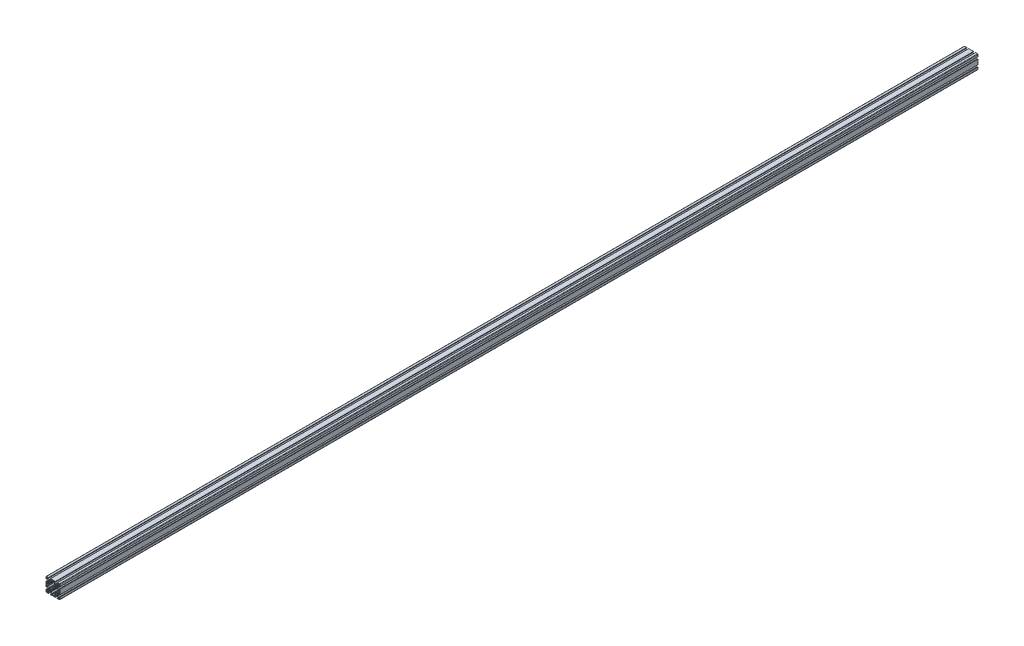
from build123d import *

# Parameters (mm, degrees)
EXTRUDE1_DEPTH = 4000


with BuildPart() as part:
    # Sketch1 → Extrude1 (new body)
    with BuildSketch(Plane.XY):
        with BuildLine():
            Line((-14.49997, -25.99994), (-13.242500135, -25.99994))
            ThreePointArc((-13.242500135, -25.99994), (-12.888946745, -25.853493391), (-12.742500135, -25.49994))
            Line((-12.742500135, -25.49994), (-12.742500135, -22.267405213))
            ThreePointArc((-12.742500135, -22.267405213), (-12.602474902, -21.902627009), (-12.242805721, -21.7499565))
            Line((-12.242805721, -21.7499565), (-10.260208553, -21.7499565))
            ThreePointArc((-10.260208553, -21.7499565), (-10.068867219, -21.788016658), (-9.906655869, -21.896402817))
            Line((-9.906655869, -21.896402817), (-5.981129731, -25.821928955))
            ThreePointArc((-5.981129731, -25.821928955), (-5.872743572, -25.984140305), (-5.834683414, -26.175481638))
            Line((-5.834683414, -26.175481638), (-5.834683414, -29.112441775))
            Line((-5.834683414, -29.112441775), (-5.324684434, -30.062439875))
            Line((-5.324684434, -30.062439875), (-5.834683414, -31.012437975))
            Line((-5.834683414, -31.012437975), (-5.834683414, -33.824398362))
            ThreePointArc((-5.834683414, -33.824398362), (-5.872743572, -34.015739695), (-5.981129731, -34.177951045))
            Line((-5.981129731, -34.177951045), (-9.906655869, -38.103477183))
            ThreePointArc((-9.906655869, -38.103477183), (-10.068867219, -38.211863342), (-10.260208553, -38.2499235))
            Line((-10.260208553, -38.2499235), (-12.242805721, -38.2499235))
            ThreePointArc((-12.242805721, -38.2499235), (-12.602474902, -38.097252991), (-12.742500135, -37.732474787))
            Line((-12.742500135, -37.732474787), (-12.742500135, -34.49994))
            ThreePointArc((-12.742500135, -34.49994), (-12.888946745, -34.146386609), (-13.242500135, -33.99994))
            Line((-13.242500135, -33.99994), (-14.49997, -33.99994))
            ThreePointArc((-14.49997, -33.99994), (-14.853523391, -34.146386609), (-14.99997, -34.49994))
            Line((-14.99997, -34.49994), (-14.99997, -42.999914))
            ThreePointArc((-14.99997, -42.999914), (-14.414184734, -44.414124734), (-12.999974, -44.99991))
            Line((-12.999974, -44.99991), (-4.5, -44.99991))
            ThreePointArc((-4.5, -44.99991), (-4.146446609, -44.853463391), (-4, -44.49991))
            Line((-4, -44.49991), (-4, -43.242440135))
            ThreePointArc((-4, -43.242440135), (-4.146446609, -42.888886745), (-4.5, -42.742440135))
            Line((-4.5, -42.742440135), (-7.732534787, -42.742440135))
            ThreePointArc((-7.732534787, -42.742440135), (-8.097312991, -42.602414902), (-8.2499835, -42.242745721))
            Line((-8.2499835, -42.242745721), (-8.2499835, -40.260148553))
            ThreePointArc((-8.2499835, -40.260148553), (-8.211923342, -40.068807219), (-8.103537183, -39.906595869))
            Line((-8.103537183, -39.906595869), (-4.178011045, -35.981069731))
            ThreePointArc((-4.178011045, -35.981069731), (-4.015799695, -35.872683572), (-3.824458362, -35.834623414))
            Line((-3.824458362, -35.834623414), (-0.9499981, -35.834623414))
            Line((-0.9499981, -35.834623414), (0, -35.324624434))
            Line((0, -35.324624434), (0.9499981, -35.834623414))
            Line((0.9499981, -35.834623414), (3.824458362, -35.834623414))
            ThreePointArc((3.824458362, -35.834623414), (4.015799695, -35.872683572), (4.178011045, -35.981069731))
            Line((4.178011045, -35.981069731), (8.103537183, -39.906595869))
            ThreePointArc((8.103537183, -39.906595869), (8.211923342, -40.068807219), (8.2499835, -40.260148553))
            Line((8.2499835, -40.260148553), (8.2499835, -42.242745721))
            ThreePointArc((8.2499835, -42.242745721), (8.097312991, -42.602414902), (7.732534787, -42.742440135))
            Line((7.732534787, -42.742440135), (4.5, -42.742440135))
            ThreePointArc((4.5, -42.742440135), (4.146446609, -42.888886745), (4, -43.242440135))
            Line((4, -43.242440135), (4, -44.49991))
            ThreePointArc((4, -44.49991), (4.146446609, -44.853463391), (4.5, -44.99991))
            Line((4.5, -44.99991), (25.49994, -44.99991))
            ThreePointArc((25.49994, -44.99991), (25.853493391, -44.853463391), (25.99994, -44.49991))
            Line((25.99994, -44.49991), (25.99994, -43.242440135))
            ThreePointArc((25.99994, -43.242440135), (25.853493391, -42.888886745), (25.49994, -42.742440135))
            Line((25.49994, -42.742440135), (22.267405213, -42.742440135))
            ThreePointArc((22.267405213, -42.742440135), (21.902627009, -42.602414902), (21.7499565, -42.242745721))
            Line((21.7499565, -42.242745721), (21.7499565, -40.260148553))
            ThreePointArc((21.7499565, -40.260148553), (21.788016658, -40.068807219), (21.896402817, -39.906595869))
            Line((21.896402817, -39.906595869), (25.821928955, -35.981069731))
            ThreePointArc((25.821928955, -35.981069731), (25.984140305, -35.872683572), (26.175481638, -35.834623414))
            Line((26.175481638, -35.834623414), (29.0499419, -35.834623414))
            Line((29.0499419, -35.834623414), (29.99994, -35.324624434))
            Line((29.99994, -35.324624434), (30.9499381, -35.834623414))
            Line((30.9499381, -35.834623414), (33.824398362, -35.834623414))
            ThreePointArc((33.824398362, -35.834623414), (34.015739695, -35.872683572), (34.177951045, -35.981069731))
            Line((34.177951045, -35.981069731), (38.103477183, -39.906595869))
            ThreePointArc((38.103477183, -39.906595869), (38.211863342, -40.068807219), (38.2499235, -40.260148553))
            Line((38.2499235, -40.260148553), (38.2499235, -42.242745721))
            ThreePointArc((38.2499235, -42.242745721), (38.097252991, -42.602414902), (37.732474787, -42.742440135))
            Line((37.732474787, -42.742440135), (34.49994, -42.742440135))
            ThreePointArc((34.49994, -42.742440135), (34.146386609, -42.888886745), (33.99994, -43.242440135))
            Line((33.99994, -43.242440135), (33.99994, -44.49991))
            ThreePointArc((33.99994, -44.49991), (34.146386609, -44.853463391), (34.49994, -44.99991))
            Line((34.49994, -44.99991), (42.999914, -44.99991))
            ThreePointArc((42.999914, -44.99991), (44.414124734, -44.414124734), (44.99991, -42.999914))
            Line((44.99991, -42.999914), (44.99991, -34.49994))
            ThreePointArc((44.99991, -34.49994), (44.853463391, -34.146386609), (44.49991, -33.99994))
            Line((44.49991, -33.99994), (43.242440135, -33.99994))
            ThreePointArc((43.242440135, -33.99994), (42.888886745, -34.146386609), (42.742440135, -34.49994))
            Line((42.742440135, -34.49994), (42.742440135, -37.732474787))
            ThreePointArc((42.742440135, -37.732474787), (42.602414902, -38.097252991), (42.242745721, -38.2499235))
            Line((42.242745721, -38.2499235), (40.260148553, -38.2499235))
            ThreePointArc((40.260148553, -38.2499235), (40.068807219, -38.211863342), (39.906595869, -38.103477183))
            Line((39.906595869, -38.103477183), (35.981069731, -34.177951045))
            ThreePointArc((35.981069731, -34.177951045), (35.872683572, -34.015739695), (35.834623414, -33.824398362))
            Line((35.834623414, -33.824398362), (35.834623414, -31.012437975))
            Line((35.834623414, -31.012437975), (35.324624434, -30.062439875))
            Line((35.324624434, -30.062439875), (35.834623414, -29.112441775))
            Line((35.834623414, -29.112441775), (35.834623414, -26.175481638))
            ThreePointArc((35.834623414, -26.175481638), (35.872683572, -25.984140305), (35.981069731, -25.821928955))
            Line((35.981069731, -25.821928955), (39.906595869, -21.896402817))
            ThreePointArc((39.906595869, -21.896402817), (40.068807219, -21.788016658), (40.260148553, -21.7499565))
            Line((40.260148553, -21.7499565), (42.242745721, -21.7499565))
            ThreePointArc((42.242745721, -21.7499565), (42.602414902, -21.902627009), (42.742440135, -22.267405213))
            Line((42.742440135, -22.267405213), (42.742440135, -25.49994))
            ThreePointArc((42.742440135, -25.49994), (42.888886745, -25.853493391), (43.242440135, -25.99994))
            Line((43.242440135, -25.99994), (44.49991, -25.99994))
            ThreePointArc((44.49991, -25.99994), (44.853463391, -25.853493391), (44.99991, -25.49994))
            Line((44.99991, -25.49994), (44.99991, -4.5))
            ThreePointArc((44.99991, -4.5), (44.853463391, -4.146446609), (44.49991, -4))
            Line((44.49991, -4), (43.242440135, -4))
            ThreePointArc((43.242440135, -4), (42.888886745, -4.146446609), (42.742440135, -4.5))
            Line((42.742440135, -4.5), (42.742440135, -7.732534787))
            ThreePointArc((42.742440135, -7.732534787), (42.602414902, -8.097312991), (42.242745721, -8.2499835))
            Line((42.242745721, -8.2499835), (40.260148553, -8.2499835))
            ThreePointArc((40.260148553, -8.2499835), (40.068807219, -8.211923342), (39.906595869, -8.103537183))
            Line((39.906595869, -8.103537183), (35.981069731, -4.178011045))
            ThreePointArc((35.981069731, -4.178011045), (35.872683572, -4.015799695), (35.834623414, -3.824458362))
            Line((35.834623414, -3.824458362), (35.834623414, -1.012497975))
            Line((35.834623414, -1.012497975), (35.324624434, -0.062499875))
            Line((35.324624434, -0.062499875), (35.834623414, 0.887498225))
            Line((35.834623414, 0.887498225), (35.834623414, 3.824458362))
            ThreePointArc((35.834623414, 3.824458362), (35.872683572, 4.015799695), (35.981069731, 4.178011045))
            Line((35.981069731, 4.178011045), (39.906595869, 8.103537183))
            ThreePointArc((39.906595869, 8.103537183), (40.068807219, 8.211923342), (40.260148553, 8.2499835))
            Line((40.260148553, 8.2499835), (42.242745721, 8.2499835))
            ThreePointArc((42.242745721, 8.2499835), (42.602414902, 8.097312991), (42.742440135, 7.732534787))
            Line((42.742440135, 7.732534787), (42.742440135, 4.5))
            ThreePointArc((42.742440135, 4.5), (42.888886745, 4.146446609), (43.242440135, 4))
            Line((43.242440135, 4), (44.49991, 4))
            ThreePointArc((44.49991, 4), (44.853463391, 4.146446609), (44.99991, 4.5))
            Line((44.99991, 4.5), (44.99991, 12.999974))
            ThreePointArc((44.99991, 12.999974), (44.414124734, 14.414184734), (42.999914, 14.99997))
            Line((42.999914, 14.99997), (34.49994, 14.99997))
            ThreePointArc((34.49994, 14.99997), (34.146386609, 14.853523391), (33.99994, 14.49997))
            Line((33.99994, 14.49997), (33.99994, 13.242500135))
            ThreePointArc((33.99994, 13.242500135), (34.146386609, 12.888946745), (34.49994, 12.742500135))
            Line((34.49994, 12.742500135), (37.732474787, 12.742500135))
            ThreePointArc((37.732474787, 12.742500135), (38.097252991, 12.602474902), (38.2499235, 12.242805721))
            Line((38.2499235, 12.242805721), (38.2499235, 10.260208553))
            ThreePointArc((38.2499235, 10.260208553), (38.211863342, 10.068867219), (38.103477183, 9.906655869))
            Line((38.103477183, 9.906655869), (34.177951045, 5.981129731))
            ThreePointArc((34.177951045, 5.981129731), (34.015739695, 5.872743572), (33.824398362, 5.834683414))
            Line((33.824398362, 5.834683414), (30.9499381, 5.834683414))
            Line((30.9499381, 5.834683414), (29.99994, 5.324684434))
            Line((29.99994, 5.324684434), (29.0499419, 5.834683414))
            Line((29.0499419, 5.834683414), (26.175481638, 5.834683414))
            ThreePointArc((26.175481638, 5.834683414), (25.984140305, 5.872743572), (25.821928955, 5.981129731))
            Line((25.821928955, 5.981129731), (21.896402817, 9.906655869))
            ThreePointArc((21.896402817, 9.906655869), (21.788016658, 10.068867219), (21.7499565, 10.260208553))
            Line((21.7499565, 10.260208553), (21.7499565, 12.242805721))
            ThreePointArc((21.7499565, 12.242805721), (21.902627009, 12.602474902), (22.267405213, 12.742500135))
            Line((22.267405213, 12.742500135), (25.49994, 12.742500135))
            ThreePointArc((25.49994, 12.742500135), (25.853493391, 12.888946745), (25.99994, 13.242500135))
            Line((25.99994, 13.242500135), (25.99994, 14.49997))
            ThreePointArc((25.99994, 14.49997), (25.853493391, 14.853523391), (25.49994, 14.99997))
            Line((25.49994, 14.99997), (4.5, 14.99997))
            ThreePointArc((4.5, 14.99997), (4.146446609, 14.853523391), (4, 14.49997))
            Line((4, 14.49997), (4, 13.242500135))
            ThreePointArc((4, 13.242500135), (4.146446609, 12.888946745), (4.5, 12.742500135))
            Line((4.5, 12.742500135), (7.732534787, 12.742500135))
            ThreePointArc((7.732534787, 12.742500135), (8.097312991, 12.602474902), (8.2499835, 12.242805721))
            Line((8.2499835, 12.242805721), (8.2499835, 10.260208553))
            ThreePointArc((8.2499835, 10.260208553), (8.211923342, 10.068867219), (8.103537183, 9.906655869))
            Line((8.103537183, 9.906655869), (4.178011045, 5.981129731))
            ThreePointArc((4.178011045, 5.981129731), (4.015799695, 5.872743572), (3.824458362, 5.834683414))
            Line((3.824458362, 5.834683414), (0.9499981, 5.834683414))
            Line((0.9499981, 5.834683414), (0, 5.324684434))
            Line((0, 5.324684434), (-0.9499981, 5.834683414))
            Line((-0.9499981, 5.834683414), (-3.824458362, 5.834683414))
            ThreePointArc((-3.824458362, 5.834683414), (-4.015799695, 5.872743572), (-4.178011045, 5.981129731))
            Line((-4.178011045, 5.981129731), (-8.103537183, 9.906655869))
            ThreePointArc((-8.103537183, 9.906655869), (-8.211923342, 10.068867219), (-8.2499835, 10.260208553))
            Line((-8.2499835, 10.260208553), (-8.2499835, 12.242805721))
            ThreePointArc((-8.2499835, 12.242805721), (-8.097312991, 12.602474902), (-7.732534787, 12.742500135))
            Line((-7.732534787, 12.742500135), (-4.5, 12.742500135))
            ThreePointArc((-4.5, 12.742500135), (-4.146446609, 12.888946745), (-4, 13.242500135))
            Line((-4, 13.242500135), (-4, 14.49997))
            ThreePointArc((-4, 14.49997), (-4.146446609, 14.853523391), (-4.5, 14.99997))
            Line((-4.5, 14.99997), (-12.999974, 14.99997))
            ThreePointArc((-12.999974, 14.99997), (-14.414184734, 14.414184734), (-14.99997, 12.999974))
            Line((-14.99997, 12.999974), (-14.99997, 4.5))
            ThreePointArc((-14.99997, 4.5), (-14.853523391, 4.146446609), (-14.49997, 4))
            Line((-14.49997, 4), (-13.242500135, 4))
            ThreePointArc((-13.242500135, 4), (-12.888946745, 4.146446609), (-12.742500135, 4.5))
            Line((-12.742500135, 4.5), (-12.742500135, 7.732534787))
            ThreePointArc((-12.742500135, 7.732534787), (-12.602474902, 8.097312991), (-12.242805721, 8.2499835))
            Line((-12.242805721, 8.2499835), (-10.260208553, 8.2499835))
            ThreePointArc((-10.260208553, 8.2499835), (-10.068867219, 8.211923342), (-9.906655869, 8.103537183))
            Line((-9.906655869, 8.103537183), (-5.981129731, 4.178011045))
            ThreePointArc((-5.981129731, 4.178011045), (-5.872743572, 4.015799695), (-5.834683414, 3.824458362))
            Line((-5.834683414, 3.824458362), (-5.834683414, 0.887498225))
            Line((-5.834683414, 0.887498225), (-5.324684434, -0.062499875))
            Line((-5.324684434, -0.062499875), (-5.834683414, -1.012497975))
            Line((-5.834683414, -1.012497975), (-5.834683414, -3.824458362))
            ThreePointArc((-5.834683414, -3.824458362), (-5.872743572, -4.015799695), (-5.981129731, -4.178011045))
            Line((-5.981129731, -4.178011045), (-9.906655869, -8.103537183))
            ThreePointArc((-9.906655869, -8.103537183), (-10.068867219, -8.211923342), (-10.260208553, -8.2499835))
            Line((-10.260208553, -8.2499835), (-12.242805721, -8.2499835))
            ThreePointArc((-12.242805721, -8.2499835), (-12.602474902, -8.097312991), (-12.742500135, -7.732534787))
            Line((-12.742500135, -7.732534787), (-12.742500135, -4.5))
            ThreePointArc((-12.742500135, -4.5), (-12.888946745, -4.146446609), (-13.242500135, -4))
            Line((-13.242500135, -4), (-14.49997, -4))
            ThreePointArc((-14.49997, -4), (-14.853523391, -4.146446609), (-14.99997, -4.5))
            Line((-14.99997, -4.5), (-14.99997, -25.49994))
            ThreePointArc((-14.99997, -25.49994), (-14.853523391, -25.853493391), (-14.49997, -25.99994))
        make_face()
        with BuildLine():
            Line((-13.318973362, -39.499921), (-9.87998024, -39.499921))
            ThreePointArc((-9.87998024, -39.499921), (-9.611280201, -39.611220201), (-9.499981, -39.87992024))
            Line((-9.499981, -39.87992024), (-9.499981, -43.318913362))
            ThreePointArc((-9.499981, -43.318913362), (-9.611573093, -43.588320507), (-9.880980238, -43.6999126))
            Line((-9.880980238, -43.6999126), (-12.6999746, -43.6999126))
            ThreePointArc((-12.6999746, -43.6999126), (-13.407079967, -43.407019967), (-13.6999726, -42.6999146))
            Line((-13.6999726, -42.6999146), (-13.6999726, -39.880920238))
            ThreePointArc((-13.6999726, -39.880920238), (-13.588380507, -39.611513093), (-13.318973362, -39.499921))
        make_face(mode=Mode.SUBTRACT)
        with BuildLine():
            Line((39.499921, -43.318913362), (39.499921, -39.87992024))
            ThreePointArc((39.499921, -39.87992024), (39.611220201, -39.611220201), (39.87992024, -39.499921))
            Line((39.87992024, -39.499921), (43.318913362, -39.499921))
            ThreePointArc((43.318913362, -39.499921), (43.588320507, -39.611513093), (43.6999126, -39.880920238))
            Line((43.6999126, -39.880920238), (43.6999126, -42.6999146))
            ThreePointArc((43.6999126, -42.6999146), (43.407019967, -43.407019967), (42.6999146, -43.6999126))
            Line((42.6999146, -43.6999126), (39.880920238, -43.6999126))
            ThreePointArc((39.880920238, -43.6999126), (39.611513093, -43.588320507), (39.499921, -43.318913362))
        make_face(mode=Mode.SUBTRACT)
        with BuildLine():
            Line((39.880920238, 13.6999726), (42.6999146, 13.6999726))
            ThreePointArc((42.6999146, 13.6999726), (43.407019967, 13.407079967), (43.6999126, 12.6999746))
            Line((43.6999126, 12.6999746), (43.6999126, 9.880980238))
            ThreePointArc((43.6999126, 9.880980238), (43.588320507, 9.611573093), (43.318913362, 9.499981))
            Line((43.318913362, 9.499981), (39.87992024, 9.499981))
            ThreePointArc((39.87992024, 9.499981), (39.611220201, 9.611280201), (39.499921, 9.87998024))
            Line((39.499921, 9.87998024), (39.499921, 13.318973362))
            ThreePointArc((39.499921, 13.318973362), (39.611513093, 13.588380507), (39.880920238, 13.6999726))
        make_face(mode=Mode.SUBTRACT)
        with BuildLine():
            Line((-9.499981, 13.318973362), (-9.499981, 9.87998024))
            ThreePointArc((-9.499981, 9.87998024), (-9.611280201, 9.611280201), (-9.87998024, 9.499981))
            Line((-9.87998024, 9.499981), (-13.318973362, 9.499981))
            ThreePointArc((-13.318973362, 9.499981), (-13.588380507, 9.611573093), (-13.6999726, 9.880980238))
            Line((-13.6999726, 9.880980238), (-13.6999726, 12.6999746))
            ThreePointArc((-13.6999726, 12.6999746), (-13.407079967, 13.407079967), (-12.6999746, 13.6999726))
            Line((-12.6999746, 13.6999726), (-9.880980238, 13.6999726))
            ThreePointArc((-9.880980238, 13.6999726), (-9.611573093, 13.588380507), (-9.499981, 13.318973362))
        make_face(mode=Mode.SUBTRACT)
        with BuildLine():
            Line((-1.494228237, -3.198145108), (-2.473346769, -3.979935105))
            ThreePointArc((-2.473346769, -3.979935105), (-3.900235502, -3.900235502), (-3.979935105, -2.473346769))
            Line((-3.979935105, -2.473346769), (-3.198145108, -1.494228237))
            ThreePointArc((-3.198145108, -1.494228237), (-3.52999294, 0), (-3.198145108, 1.494228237))
            Line((-3.198145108, 1.494228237), (-3.979935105, 2.473346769))
            ThreePointArc((-3.979935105, 2.473346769), (-3.900235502, 3.900235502), (-2.473346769, 3.979935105))
            Line((-2.473346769, 3.979935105), (-1.494228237, 3.198145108))
            ThreePointArc((-1.494228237, 3.198145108), (0, 3.52999294), (1.494228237, 3.198145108))
            Line((1.494228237, 3.198145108), (2.473346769, 3.979935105))
            ThreePointArc((2.473346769, 3.979935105), (3.900235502, 3.900235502), (3.979935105, 2.473346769))
            Line((3.979935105, 2.473346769), (3.198145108, 1.494228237))
            ThreePointArc((3.198145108, 1.494228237), (3.52999294, 0), (3.198145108, -1.494228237))
            Line((3.198145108, -1.494228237), (3.979935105, -2.473346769))
            ThreePointArc((3.979935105, -2.473346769), (3.900235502, -3.900235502), (2.473346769, -3.979935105))
            Line((2.473346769, -3.979935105), (1.494228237, -3.198145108))
            ThreePointArc((1.494228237, -3.198145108), (0, -3.52999294), (-1.494228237, -3.198145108))
        make_face(mode=Mode.SUBTRACT)
        with BuildLine():
            Line((28.505711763, -3.198145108), (27.526593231, -3.979935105))
            ThreePointArc((27.526593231, -3.979935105), (26.099704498, -3.900235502), (26.020004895, -2.473346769))
            Line((26.020004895, -2.473346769), (26.801794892, -1.494228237))
            ThreePointArc((26.801794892, -1.494228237), (26.46994706, 0), (26.801794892, 1.494228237))
            Line((26.801794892, 1.494228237), (26.020004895, 2.473346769))
            ThreePointArc((26.020004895, 2.473346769), (26.099704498, 3.900235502), (27.526593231, 3.979935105))
            Line((27.526593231, 3.979935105), (28.505711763, 3.198145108))
            ThreePointArc((28.505711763, 3.198145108), (29.99994, 3.52999294), (31.494168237, 3.198145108))
            Line((31.494168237, 3.198145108), (32.473286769, 3.979935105))
            ThreePointArc((32.473286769, 3.979935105), (33.900175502, 3.900235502), (33.979875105, 2.473346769))
            Line((33.979875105, 2.473346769), (33.198085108, 1.494228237))
            ThreePointArc((33.198085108, 1.494228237), (33.52993294, 0), (33.198085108, -1.494228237))
            Line((33.198085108, -1.494228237), (33.979875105, -2.473346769))
            ThreePointArc((33.979875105, -2.473346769), (33.900175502, -3.900235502), (32.473286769, -3.979935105))
            Line((32.473286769, -3.979935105), (31.494168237, -3.198145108))
            ThreePointArc((31.494168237, -3.198145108), (29.99994, -3.52999294), (28.505711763, -3.198145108))
        make_face(mode=Mode.SUBTRACT)
        with BuildLine():
            Line((-1.494228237, -33.198085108), (-2.473346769, -33.979875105))
            ThreePointArc((-2.473346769, -33.979875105), (-3.900235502, -33.900175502), (-3.979935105, -32.473286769))
            Line((-3.979935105, -32.473286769), (-3.198145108, -31.494168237))
            ThreePointArc((-3.198145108, -31.494168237), (-3.52999294, -29.99994), (-3.198145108, -28.505711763))
            Line((-3.198145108, -28.505711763), (-3.979935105, -27.526593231))
            ThreePointArc((-3.979935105, -27.526593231), (-3.900235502, -26.099704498), (-2.473346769, -26.020004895))
            Line((-2.473346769, -26.020004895), (-1.494228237, -26.801794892))
            ThreePointArc((-1.494228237, -26.801794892), (0, -26.46994706), (1.494228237, -26.801794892))
            Line((1.494228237, -26.801794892), (2.473346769, -26.020004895))
            ThreePointArc((2.473346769, -26.020004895), (3.900235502, -26.099704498), (3.979935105, -27.526593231))
            Line((3.979935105, -27.526593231), (3.198145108, -28.505711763))
            ThreePointArc((3.198145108, -28.505711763), (3.52999294, -29.99994), (3.198145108, -31.494168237))
            Line((3.198145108, -31.494168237), (3.979935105, -32.473286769))
            ThreePointArc((3.979935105, -32.473286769), (3.900235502, -33.900175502), (2.473346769, -33.979875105))
            Line((2.473346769, -33.979875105), (1.494228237, -33.198085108))
            ThreePointArc((1.494228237, -33.198085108), (0, -33.52993294), (-1.494228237, -33.198085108))
        make_face(mode=Mode.SUBTRACT)
        with BuildLine():
            Line((28.505711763, -33.198085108), (27.526593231, -33.979875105))
            ThreePointArc((27.526593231, -33.979875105), (26.099704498, -33.900175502), (26.020004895, -32.473286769))
            Line((26.020004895, -32.473286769), (26.801794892, -31.494168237))
            ThreePointArc((26.801794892, -31.494168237), (26.46994706, -29.99994), (26.801794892, -28.505711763))
            Line((26.801794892, -28.505711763), (26.020004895, -27.526593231))
            ThreePointArc((26.020004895, -27.526593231), (26.099704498, -26.099704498), (27.526593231, -26.020004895))
            Line((27.526593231, -26.020004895), (28.505711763, -26.801794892))
            ThreePointArc((28.505711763, -26.801794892), (29.99994, -26.46994706), (31.494168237, -26.801794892))
            Line((31.494168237, -26.801794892), (32.473286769, -26.020004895))
            ThreePointArc((32.473286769, -26.020004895), (33.900175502, -26.099704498), (33.979875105, -27.526593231))
            Line((33.979875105, -27.526593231), (33.198085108, -28.505711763))
            ThreePointArc((33.198085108, -28.505711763), (33.52993294, -29.99994), (33.198085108, -31.494168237))
            Line((33.198085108, -31.494168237), (33.979875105, -32.473286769))
            ThreePointArc((33.979875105, -32.473286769), (33.900175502, -33.900175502), (32.473286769, -33.979875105))
            Line((32.473286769, -33.979875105), (31.494168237, -33.198085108))
            ThreePointArc((31.494168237, -33.198085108), (29.99994, -33.52993294), (28.505711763, -33.198085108))
        make_face(mode=Mode.SUBTRACT)
        with BuildLine():
            Line((42.7999144, -10.9499781), (42.7999144, -19.0499619))
            ThreePointArc((42.7999144, -19.0499619), (42.653468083, -19.403514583), (42.2999154, -19.5499609))
            Line((42.2999154, -19.5499609), (39.268119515, -19.5499609))
            ThreePointArc((39.268119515, -19.5499609), (38.694095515, -19.664141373), (38.207461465, -19.98929985))
            Line((38.207461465, -19.98929985), (34.177951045, -24.018810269))
            ThreePointArc((34.177951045, -24.018810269), (34.015739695, -24.127196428), (33.824398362, -24.165256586))
            Line((33.824398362, -24.165256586), (30.9499381, -24.165256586))
            Line((30.9499381, -24.165256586), (29.99994, -24.675255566))
            Line((29.99994, -24.675255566), (29.0499419, -24.165256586))
            Line((29.0499419, -24.165256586), (26.165252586, -24.165256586))
            ThreePointArc((26.165252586, -24.165256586), (24.751041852, -24.751041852), (24.165256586, -26.165252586))
            Line((24.165256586, -26.165252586), (24.165256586, -29.112441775))
            Line((24.165256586, -29.112441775), (24.675255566, -30.062439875))
            Line((24.675255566, -30.062439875), (24.165256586, -31.012437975))
            Line((24.165256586, -31.012437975), (24.165256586, -33.824398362))
            ThreePointArc((24.165256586, -33.824398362), (24.127196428, -34.015739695), (24.018810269, -34.177951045))
            Line((24.018810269, -34.177951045), (19.98929985, -38.207461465))
            ThreePointArc((19.98929985, -38.207461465), (19.664141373, -38.694095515), (19.5499609, -39.268119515))
            Line((19.5499609, -39.268119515), (19.5499609, -42.2999154))
            ThreePointArc((19.5499609, -42.2999154), (19.403514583, -42.653468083), (19.0499619, -42.7999144))
            Line((19.0499619, -42.7999144), (10.9499781, -42.7999144))
            ThreePointArc((10.9499781, -42.7999144), (10.596425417, -42.653468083), (10.4499791, -42.2999154))
            Line((10.4499791, -42.2999154), (10.4499791, -39.268119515))
            ThreePointArc((10.4499791, -39.268119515), (10.335798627, -38.694095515), (10.01064015, -38.207461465))
            Line((10.01064015, -38.207461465), (5.981129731, -34.177951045))
            ThreePointArc((5.981129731, -34.177951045), (5.872743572, -34.015739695), (5.834683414, -33.824398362))
            Line((5.834683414, -33.824398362), (5.834683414, -31.012437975))
            Line((5.834683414, -31.012437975), (5.324684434, -30.062439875))
            Line((5.324684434, -30.062439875), (5.834683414, -29.112441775))
            Line((5.834683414, -29.112441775), (5.834683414, -26.165252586))
            ThreePointArc((5.834683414, -26.165252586), (5.248898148, -24.751041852), (3.834687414, -24.165256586))
            Line((3.834687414, -24.165256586), (0.9499981, -24.165256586))
            Line((0.9499981, -24.165256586), (0, -24.675255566))
            Line((0, -24.675255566), (-0.9499981, -24.165256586))
            Line((-0.9499981, -24.165256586), (-3.824458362, -24.165256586))
            ThreePointArc((-3.824458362, -24.165256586), (-4.015799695, -24.127196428), (-4.178011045, -24.018810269))
            Line((-4.178011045, -24.018810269), (-8.207521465, -19.98929985))
            ThreePointArc((-8.207521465, -19.98929985), (-8.694155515, -19.664141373), (-9.268179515, -19.5499609))
            Line((-9.268179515, -19.5499609), (-12.2999754, -19.5499609))
            ThreePointArc((-12.2999754, -19.5499609), (-12.653528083, -19.403514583), (-12.7999744, -19.0499619))
            Line((-12.7999744, -19.0499619), (-12.7999744, -10.9499781))
            ThreePointArc((-12.7999744, -10.9499781), (-12.653528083, -10.596425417), (-12.2999754, -10.4499791))
            Line((-12.2999754, -10.4499791), (-9.268179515, -10.4499791))
            ThreePointArc((-9.268179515, -10.4499791), (-8.694155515, -10.335798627), (-8.207521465, -10.01064015))
            Line((-8.207521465, -10.01064015), (-4.178011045, -5.981129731))
            ThreePointArc((-4.178011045, -5.981129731), (-4.015799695, -5.872743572), (-3.824458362, -5.834683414))
            Line((-3.824458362, -5.834683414), (-0.9499981, -5.834683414))
            Line((-0.9499981, -5.834683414), (0, -5.324684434))
            Line((0, -5.324684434), (0.9499981, -5.834683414))
            Line((0.9499981, -5.834683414), (3.834687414, -5.834683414))
            ThreePointArc((3.834687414, -5.834683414), (5.248898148, -5.248898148), (5.834683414, -3.834687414))
            Line((5.834683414, -3.834687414), (5.834683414, -1.012497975))
            Line((5.834683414, -1.012497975), (5.324684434, -0.062499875))
            Line((5.324684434, -0.062499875), (5.834683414, 0.887498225))
            Line((5.834683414, 0.887498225), (5.834683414, 3.824458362))
            ThreePointArc((5.834683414, 3.824458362), (5.872743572, 4.015799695), (5.981129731, 4.178011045))
            Line((5.981129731, 4.178011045), (10.01064015, 8.207521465))
            ThreePointArc((10.01064015, 8.207521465), (10.335798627, 8.694155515), (10.4499791, 9.268179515))
            Line((10.4499791, 9.268179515), (10.4499791, 12.2999754))
            ThreePointArc((10.4499791, 12.2999754), (10.596425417, 12.653528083), (10.9499781, 12.7999744))
            Line((10.9499781, 12.7999744), (19.0499619, 12.7999744))
            ThreePointArc((19.0499619, 12.7999744), (19.403514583, 12.653528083), (19.5499609, 12.2999754))
            Line((19.5499609, 12.2999754), (19.5499609, 9.268179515))
            ThreePointArc((19.5499609, 9.268179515), (19.664141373, 8.694155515), (19.98929985, 8.207521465))
            Line((19.98929985, 8.207521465), (24.018810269, 4.178011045))
            ThreePointArc((24.018810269, 4.178011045), (24.127196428, 4.015799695), (24.165256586, 3.824458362))
            Line((24.165256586, 3.824458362), (24.165256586, 0.887498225))
            Line((24.165256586, 0.887498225), (24.675255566, -0.062499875))
            Line((24.675255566, -0.062499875), (24.165256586, -1.012497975))
            Line((24.165256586, -1.012497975), (24.165256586, -3.834687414))
            ThreePointArc((24.165256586, -3.834687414), (24.751041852, -5.248898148), (26.165252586, -5.834683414))
            Line((26.165252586, -5.834683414), (29.0499419, -5.834683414))
            Line((29.0499419, -5.834683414), (29.99994, -5.324684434))
            Line((29.99994, -5.324684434), (30.9499381, -5.834683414))
            Line((30.9499381, -5.834683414), (33.824398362, -5.834683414))
            ThreePointArc((33.824398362, -5.834683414), (34.015739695, -5.872743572), (34.177951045, -5.981129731))
            Line((34.177951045, -5.981129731), (38.207461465, -10.01064015))
            ThreePointArc((38.207461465, -10.01064015), (38.694095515, -10.335798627), (39.268119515, -10.4499791))
            Line((39.268119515, -10.4499791), (42.2999154, -10.4499791))
            ThreePointArc((42.2999154, -10.4499791), (42.653468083, -10.596425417), (42.7999144, -10.9499781))
        make_face(mode=Mode.SUBTRACT)
    extrude(amount=-EXTRUDE1_DEPTH)


solid = part.part
